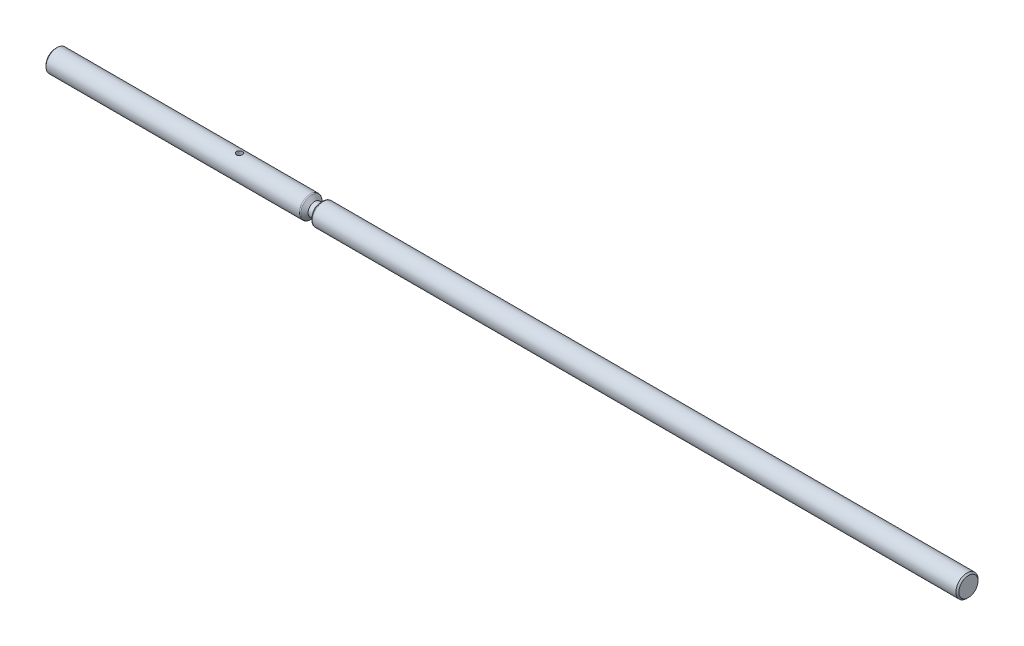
ISO-10303-21;
HEADER;
FILE_DESCRIPTION(('STEP AP214'),'2;1');
FILE_NAME('part.step','',(''),(''),'','','');
FILE_SCHEMA(('AUTOMOTIVE_DESIGN { 1 0 10303 214 1 1 1 1 }'));
ENDSEC;
DATA;
#1=APPLICATION_CONTEXT('core data for automotive mechanical design processes');
#2=APPLICATION_PROTOCOL_DEFINITION('international standard','automotive_design',2000,#1);
#3=PRODUCT_CONTEXT('',#1,'mechanical');
#4=PRODUCT('Part','Part','',(#3));
#5=PRODUCT_RELATED_PRODUCT_CATEGORY('part','',(#4));
#6=PRODUCT_DEFINITION_FORMATION('','',#4);
#7=PRODUCT_DEFINITION_CONTEXT('part definition',#1,'design');
#8=PRODUCT_DEFINITION('design','',#6,#7);
#9=PRODUCT_DEFINITION_SHAPE('','',#8);
#10=(LENGTH_UNIT() NAMED_UNIT(*) SI_UNIT(.MILLI.,.METRE.));
#11=(NAMED_UNIT(*) PLANE_ANGLE_UNIT() SI_UNIT($,.RADIAN.));
#12=(NAMED_UNIT(*) SI_UNIT($,.STERADIAN.) SOLID_ANGLE_UNIT());
#13=UNCERTAINTY_MEASURE_WITH_UNIT(LENGTH_MEASURE(1.E-05),#10,'distance_accuracy_value','');
#14=(GEOMETRIC_REPRESENTATION_CONTEXT(3) GLOBAL_UNCERTAINTY_ASSIGNED_CONTEXT((#13)) GLOBAL_UNIT_ASSIGNED_CONTEXT((#10,
#11,#12)) REPRESENTATION_CONTEXT('',''));
#15=CARTESIAN_POINT('',(0.,0.,0.));
#16=DIRECTION('',(0.,0.,1.));
#17=DIRECTION('',(1.,0.,0.));
#18=AXIS2_PLACEMENT_3D('',#15,#16,#17);
#19=CARTESIAN_POINT('',(0.,0.,0.));
#20=DIRECTION('',(1.,0.,0.));
#21=DIRECTION('',(0.,0.,-1.));
#22=AXIS2_PLACEMENT_3D('',#19,#20,#21);
#23=PLANE('',#22);
#24=CARTESIAN_POINT('',(0.,0.,0.));
#25=DIRECTION('',(-1.,0.,0.));
#26=DIRECTION('',(0.,0.,1.));
#27=AXIS2_PLACEMENT_3D('',#24,#25,#26);
#28=CIRCLE('',#27,6.49999999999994);
#29=CARTESIAN_POINT('',(0.,0.,6.49999999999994));
#30=VERTEX_POINT('',#29);
#31=EDGE_CURVE('E101',#30,#30,#28,.T.);
#32=ORIENTED_EDGE('',*,*,#31,.T.);
#33=EDGE_LOOP('',(#32));
#34=FACE_BOUND('',#33,.T.);
#35=ADVANCED_FACE('F25',(#34),#23,.F.);
#36=CARTESIAN_POINT('',(1.,0.,0.));
#37=DIRECTION('',(1.,0.,0.));
#38=DIRECTION('',(0.,0.,-1.));
#39=AXIS2_PLACEMENT_3D('',#36,#37,#38);
#40=CONICAL_SURFACE('',#39,7.49999999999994,0.785398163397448);
#41=ORIENTED_EDGE('',*,*,#31,.F.);
#42=EDGE_LOOP('',(#41));
#43=FACE_BOUND('',#42,.T.);
#44=CARTESIAN_POINT('',(1.,0.,0.));
#45=DIRECTION('',(-1.,0.,0.));
#46=DIRECTION('',(0.,0.,1.));
#47=AXIS2_PLACEMENT_3D('',#44,#45,#46);
#48=CIRCLE('',#47,7.49999999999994);
#49=CARTESIAN_POINT('',(1.,0.,7.49999999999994));
#50=VERTEX_POINT('',#49);
#51=EDGE_CURVE('E102',#50,#50,#48,.T.);
#52=ORIENTED_EDGE('',*,*,#51,.T.);
#53=EDGE_LOOP('',(#52));
#54=FACE_BOUND('',#53,.T.);
#55=ADVANCED_FACE('F91',(#43,#54),#40,.T.);
#56=CARTESIAN_POINT('',(0.,0.,0.));
#57=DIRECTION('',(-1.,0.,0.));
#58=DIRECTION('',(0.,0.,1.));
#59=AXIS2_PLACEMENT_3D('',#56,#57,#58);
#60=CYLINDRICAL_SURFACE('',#59,7.49999999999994);
#61=CARTESIAN_POINT('',(173.031625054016,0.,0.));
#62=DIRECTION('',(1.,0.,0.));
#63=DIRECTION('',(0.,0.,-1.));
#64=AXIS2_PLACEMENT_3D('',#61,#62,#63);
#65=CIRCLE('',#64,7.49999999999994);
#66=CARTESIAN_POINT('',(173.031625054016,0.,-7.49999999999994));
#67=VERTEX_POINT('',#66);
#68=EDGE_CURVE('E31',#67,#67,#65,.F.);
#69=ORIENTED_EDGE('',*,*,#68,.T.);
#70=EDGE_LOOP('',(#69));
#71=FACE_BOUND('',#70,.T.);
#72=CARTESIAN_POINT('',(123.,-7.49999999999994,0.));
#73=CARTESIAN_POINT('',(123.000002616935,-7.49999833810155,0.110254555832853));
#74=CARTESIAN_POINT('',(123.00914761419,-7.49754486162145,0.220537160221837));
#75=CARTESIAN_POINT('',(123.045421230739,-7.48799573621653,0.43792545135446));
#76=CARTESIAN_POINT('',(123.072558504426,-7.4808978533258,0.545029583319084));
#77=CARTESIAN_POINT('',(123.143871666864,-7.46284333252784,0.752891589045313));
#78=CARTESIAN_POINT('',(123.188025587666,-7.45189167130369,0.853657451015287));
#79=CARTESIAN_POINT('',(123.292037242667,-7.42728699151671,1.04635368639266));
#80=CARTESIAN_POINT('',(123.351896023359,-7.41363379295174,1.13828347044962));
#81=CARTESIAN_POINT('',(123.487083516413,-7.38474614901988,1.31282950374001));
#82=CARTESIAN_POINT('',(123.562708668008,-7.36948467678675,1.39521168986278));
#83=CARTESIAN_POINT('',(123.726648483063,-7.33927409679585,1.54628713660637));
#84=CARTESIAN_POINT('',(123.814964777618,-7.32432502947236,1.61497863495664));
#85=CARTESIAN_POINT('',(124.003648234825,-7.29615537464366,1.73786409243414));
#86=CARTESIAN_POINT('',(124.104196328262,-7.28296888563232,1.79178877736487));
#87=CARTESIAN_POINT('',(124.313340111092,-7.26021477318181,1.88187548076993));
#88=CARTESIAN_POINT('',(124.421934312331,-7.25064648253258,1.91804077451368));
#89=CARTESIAN_POINT('',(124.641495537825,-7.23649115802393,1.97076920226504));
#90=CARTESIAN_POINT('',(124.752353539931,-7.23179647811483,1.98775670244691));
#91=CARTESIAN_POINT('',(124.975437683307,-7.22759830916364,2.00297034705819));
#92=CARTESIAN_POINT('',(125.087663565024,-7.22809385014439,2.00119999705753));
#93=CARTESIAN_POINT('',(125.306985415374,-7.23412378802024,1.97928510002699));
#94=CARTESIAN_POINT('',(125.414137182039,-7.23951735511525,1.95965406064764));
#95=CARTESIAN_POINT('',(125.623568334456,-7.25451013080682,1.90339748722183));
#96=CARTESIAN_POINT('',(125.725847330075,-7.26410967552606,1.86677059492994));
#97=CARTESIAN_POINT('',(125.923968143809,-7.2865566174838,1.77714356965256));
#98=CARTESIAN_POINT('',(126.019724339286,-7.29943942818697,1.72396341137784));
#99=CARTESIAN_POINT('',(126.201134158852,-7.32698229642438,1.60286503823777));
#100=CARTESIAN_POINT('',(126.286785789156,-7.3416427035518,1.53494392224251));
#101=CARTESIAN_POINT('',(126.448488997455,-7.37167510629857,1.38366607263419));
#102=CARTESIAN_POINT('',(126.524136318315,-7.38705471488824,1.29987812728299));
#103=CARTESIAN_POINT('',(126.66038878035,-7.4163638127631,1.12061766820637));
#104=CARTESIAN_POINT('',(126.720993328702,-7.43029324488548,1.02514469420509));
#105=CARTESIAN_POINT('',(126.825617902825,-7.45521820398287,0.824598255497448));
#106=CARTESIAN_POINT('',(126.869564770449,-7.46620072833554,0.719484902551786));
#107=CARTESIAN_POINT('',(126.939047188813,-7.48390044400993,0.503002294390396));
#108=CARTESIAN_POINT('',(126.964586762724,-7.49061856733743,0.391634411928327));
#109=CARTESIAN_POINT('',(126.995894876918,-7.49889158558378,0.169254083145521));
#110=CARTESIAN_POINT('',(127.002213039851,-7.50058997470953,0.0583242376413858));
#111=CARTESIAN_POINT('',(126.996416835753,-7.49904471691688,-0.163010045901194));
#112=CARTESIAN_POINT('',(126.984304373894,-7.49580158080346,-0.27341453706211));
#113=CARTESIAN_POINT('',(126.94244155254,-7.48483035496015,-0.488602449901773));
#114=CARTESIAN_POINT('',(126.912997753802,-7.47718026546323,-0.593449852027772));
#115=CARTESIAN_POINT('',(126.837664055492,-7.45826294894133,-0.796706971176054));
#116=CARTESIAN_POINT('',(126.791772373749,-7.44699532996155,-0.895115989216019));
#117=CARTESIAN_POINT('',(126.683826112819,-7.42175660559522,-1.08483847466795));
#118=CARTESIAN_POINT('',(126.621472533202,-7.40773686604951,-1.17597518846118));
#119=CARTESIAN_POINT('',(126.482748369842,-7.37861452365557,-1.34668463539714));
#120=CARTESIAN_POINT('',(126.406375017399,-7.36351170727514,-1.42625507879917));
#121=CARTESIAN_POINT('',(126.239214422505,-7.33339745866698,-1.57388924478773));
#122=CARTESIAN_POINT('',(126.148081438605,-7.31840061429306,-1.64156519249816));
#123=CARTESIAN_POINT('',(125.9554353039,-7.29066447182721,-1.76067191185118));
#124=CARTESIAN_POINT('',(125.853922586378,-7.2779250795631,-1.8121033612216));
#125=CARTESIAN_POINT('',(125.643904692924,-7.25629268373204,-1.89687411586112));
#126=CARTESIAN_POINT('',(125.535444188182,-7.24737748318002,-1.93031812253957));
#127=CARTESIAN_POINT('',(125.314160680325,-7.23439825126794,-1.97841205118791));
#128=CARTESIAN_POINT('',(125.201338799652,-7.23033298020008,-1.99306677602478));
#129=CARTESIAN_POINT('',(124.978505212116,-7.22761744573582,-2.00288989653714));
#130=CARTESIAN_POINT('',(124.868522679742,-7.22879397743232,-1.99868155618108));
#131=CARTESIAN_POINT('',(124.65089648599,-7.23602396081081,-1.97234376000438));
#132=CARTESIAN_POINT('',(124.543252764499,-7.24207728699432,-1.95021476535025));
#133=CARTESIAN_POINT('',(124.33414424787,-7.25827571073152,-1.88902515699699));
#134=CARTESIAN_POINT('',(124.232638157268,-7.26838885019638,-1.8500966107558));
#135=CARTESIAN_POINT('',(124.037521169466,-7.29156818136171,-1.75651554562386));
#136=CARTESIAN_POINT('',(123.9439115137,-7.30463483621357,-1.70186056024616));
#137=CARTESIAN_POINT('',(123.764269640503,-7.33272921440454,-1.57648909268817));
#138=CARTESIAN_POINT('',(123.678541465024,-7.34780333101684,-1.5053472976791));
#139=CARTESIAN_POINT('',(123.520037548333,-7.37795503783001,-1.349830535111));
#140=CARTESIAN_POINT('',(123.447264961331,-7.39303262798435,-1.26545235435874));
#141=CARTESIAN_POINT('',(123.315207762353,-7.42187812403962,-1.08367998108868));
#142=CARTESIAN_POINT('',(123.256244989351,-7.43561111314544,-0.986045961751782));
#143=CARTESIAN_POINT('',(123.155662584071,-7.45983810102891,-0.781888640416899));
#144=CARTESIAN_POINT('',(123.114031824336,-7.47033417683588,-0.675371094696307));
#145=CARTESIAN_POINT('',(123.054724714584,-7.48554752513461,-0.474374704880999));
#146=CARTESIAN_POINT('',(123.034250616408,-7.49092770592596,-0.380762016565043));
#147=CARTESIAN_POINT('',(123.006887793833,-7.4981544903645,-0.19143979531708));
#148=CARTESIAN_POINT('',(122.9999977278,-7.50000144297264,-0.0957304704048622));
#149=CARTESIAN_POINT('',(123.,-7.49999999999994,0.));
#150=B_SPLINE_CURVE_WITH_KNOTS('',3,(#72,#73,#74,#75,#76,#77,#78,#79,#80,#81,#82,#83,#84,#85,
#86,#87,#88,#89,#90,#91,#92,#93,#94,#95,#96,#97,#98,#99,#100,#101,#102,#103,#104,#105,#106,#107,
#108,#109,#110,#111,#112,#113,#114,#115,#116,#117,#118,#119,#120,#121,#122,#123,#124,#125,#126,
#127,#128,#129,#130,#131,#132,#133,#134,#135,#136,#137,#138,#139,#140,#141,#142,#143,#144,#145,
#146,#147,#148,#149),.UNSPECIFIED.,.T.,.F.,(4,2,2,2,2,2,2,2,2,2,2,2,2,2,2,2,2,2,2,2,2,2,2,2,2,2,
2,2,2,2,2,2,2,2,2,2,2,2,4),(0.,0.330412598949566,0.660984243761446,0.991130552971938,
1.32129886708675,1.65834897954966,1.99544244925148,2.33832582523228,2.681145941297,
3.01622158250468,3.3512346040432,3.67691002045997,4.00261146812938,4.33198673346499,
4.66142688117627,5.00161259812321,5.34181171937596,5.6834880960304,6.02508977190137,
6.35682717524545,6.68853028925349,7.01453535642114,7.34057575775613,7.67300286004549,
8.00549568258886,8.34736496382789,8.68921998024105,9.02906297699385,9.36881908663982,
9.69743342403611,10.0260393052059,10.352107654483,10.67822717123,11.0139433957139,
11.3497412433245,11.6927225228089,12.0354832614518,12.3223981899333,12.6092847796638),.UNSPECIFIED.);
#151=CARTESIAN_POINT('',(123.,-7.49999999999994,0.));
#152=VERTEX_POINT('',#151);
#153=EDGE_CURVE('E44',#152,#152,#150,.T.);
#154=ORIENTED_EDGE('',*,*,#153,.T.);
#155=EDGE_LOOP('',(#154));
#156=FACE_BOUND('',#155,.T.);
#157=CARTESIAN_POINT('',(125.,7.22841614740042,2.));
#158=CARTESIAN_POINT('',(124.88982406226,7.22841805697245,1.99999734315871));
#159=CARTESIAN_POINT('',(124.779619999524,7.23096264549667,1.99086493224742));
#160=CARTESIAN_POINT('',(124.562394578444,7.2408356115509,1.95464583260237));
#161=CARTESIAN_POINT('',(124.455374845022,7.24816638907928,1.92755013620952));
#162=CARTESIAN_POINT('',(124.247691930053,7.26672375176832,1.85635845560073));
#163=CARTESIAN_POINT('',(124.147020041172,7.27794485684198,1.81228637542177));
#164=CARTESIAN_POINT('',(123.95448325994,7.30301154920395,1.70846784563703));
#165=CARTESIAN_POINT('',(123.862619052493,7.31685734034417,1.64872017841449));
#166=CARTESIAN_POINT('',(123.688007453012,7.3460013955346,1.51364847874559));
#167=CARTESIAN_POINT('',(123.605512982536,7.36132541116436,1.43800297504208));
#168=CARTESIAN_POINT('',(123.454218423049,7.39147701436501,1.2739742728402));
#169=CARTESIAN_POINT('',(123.385419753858,7.40630455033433,1.18558975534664));
#170=CARTESIAN_POINT('',(123.262415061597,7.43407988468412,0.996838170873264));
#171=CARTESIAN_POINT('',(123.208460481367,7.44699376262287,0.896301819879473));
#172=CARTESIAN_POINT('',(123.118315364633,7.46919126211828,0.687183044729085));
#173=CARTESIAN_POINT('',(123.082121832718,7.47847549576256,0.578601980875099));
#174=CARTESIAN_POINT('',(123.029344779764,7.49218553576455,0.359115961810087));
#175=CARTESIAN_POINT('',(123.012331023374,7.49671776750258,0.248321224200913));
#176=CARTESIAN_POINT('',(122.997042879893,7.50078524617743,0.0253635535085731));
#177=CARTESIAN_POINT('',(122.99876535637,7.50032132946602,-0.0867991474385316));
#178=CARTESIAN_POINT('',(123.020597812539,7.49452675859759,-0.306314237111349));
#179=CARTESIAN_POINT('',(123.040242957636,7.48931914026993,-0.413716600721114));
#180=CARTESIAN_POINT('',(123.096612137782,7.47476748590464,-0.623641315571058));
#181=CARTESIAN_POINT('',(123.133337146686,7.46542321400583,-0.726163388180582));
#182=CARTESIAN_POINT('',(123.223179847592,7.44346569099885,-0.924603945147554));
#183=CARTESIAN_POINT('',(123.276456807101,7.43082087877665,-1.02044668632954));
#184=CARTESIAN_POINT('',(123.397768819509,7.40362468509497,-1.20198999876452));
#185=CARTESIAN_POINT('',(123.465806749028,7.38907293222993,-1.28768858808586));
#186=CARTESIAN_POINT('',(123.617176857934,7.35911272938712,-1.44928536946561));
#187=CARTESIAN_POINT('',(123.700914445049,7.34369169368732,-1.52480192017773));
#188=CARTESIAN_POINT('',(123.880024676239,7.31413405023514,-1.66081332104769));
#189=CARTESIAN_POINT('',(123.9753980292,7.29999752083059,-1.72130725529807));
#190=CARTESIAN_POINT('',(124.175900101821,7.2745590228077,-1.82584679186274));
#191=CARTESIAN_POINT('',(124.281085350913,7.26327507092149,-1.86978866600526));
#192=CARTESIAN_POINT('',(124.497726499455,7.24504325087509,-1.93924001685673));
#193=CARTESIAN_POINT('',(124.60918083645,7.23809430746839,-1.96475406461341));
#194=CARTESIAN_POINT('',(124.831627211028,7.2295483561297,-1.99596757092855));
#195=CARTESIAN_POINT('',(124.942533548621,7.2277976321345,-2.00223632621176));
#196=CARTESIAN_POINT('',(125.163809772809,7.22942578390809,-1.9963498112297));
#197=CARTESIAN_POINT('',(125.27417971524,7.23280411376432,-1.98419650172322));
#198=CARTESIAN_POINT('',(125.489056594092,7.24416124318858,-1.9423127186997));
#199=CARTESIAN_POINT('',(125.593635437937,7.25205039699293,-1.91292447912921));
#200=CARTESIAN_POINT('',(125.79637963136,7.27145268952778,-1.83778986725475));
#201=CARTESIAN_POINT('',(125.894544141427,7.28296630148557,-1.79204135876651));
#202=CARTESIAN_POINT('',(126.084054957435,7.30863572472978,-1.68432905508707));
#203=CARTESIAN_POINT('',(126.17520397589,7.32284404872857,-1.62203095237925));
#204=CARTESIAN_POINT('',(126.345963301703,7.3521784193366,-1.48340227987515));
#205=CARTESIAN_POINT('',(126.425571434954,7.36730463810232,-1.40706907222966));
#206=CARTESIAN_POINT('',(126.57335247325,7.39729964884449,-1.23990378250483));
#207=CARTESIAN_POINT('',(126.641128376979,7.41214836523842,-1.14871641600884));
#208=CARTESIAN_POINT('',(126.760410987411,7.43946670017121,-0.955928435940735));
#209=CARTESIAN_POINT('',(126.811918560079,7.45193644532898,-0.854328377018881));
#210=CARTESIAN_POINT('',(126.896729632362,7.47301150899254,-0.644314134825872));
#211=CARTESIAN_POINT('',(126.930169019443,7.48164558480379,-0.535957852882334));
#212=CARTESIAN_POINT('',(126.978288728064,7.49420303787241,-0.314899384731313));
#213=CARTESIAN_POINT('',(126.992973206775,7.49812745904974,-0.202198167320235));
#214=CARTESIAN_POINT('',(127.002905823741,7.50077413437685,0.0206420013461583));
#215=CARTESIAN_POINT('',(126.998736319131,7.49965226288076,0.130753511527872));
#216=CARTESIAN_POINT('',(126.972431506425,7.49268490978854,0.348648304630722));
#217=CARTESIAN_POINT('',(126.950296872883,7.48683960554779,0.456431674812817));
#218=CARTESIAN_POINT('',(126.889019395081,7.47111310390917,0.665910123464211));
#219=CARTESIAN_POINT('',(126.849994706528,7.46125997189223,0.76764201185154));
#220=CARTESIAN_POINT('',(126.756150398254,7.43854816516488,0.963172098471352));
#221=CARTESIAN_POINT('',(126.701328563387,7.42568906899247,1.05696918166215));
#222=CARTESIAN_POINT('',(126.575741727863,7.39791331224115,1.23667826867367));
#223=CARTESIAN_POINT('',(126.504590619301,7.38295093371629,1.32231336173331));
#224=CARTESIAN_POINT('',(126.349097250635,7.3528400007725,1.48062537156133));
#225=CARTESIAN_POINT('',(126.264751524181,7.33769139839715,1.55329887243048));
#226=CARTESIAN_POINT('',(126.083031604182,7.30853959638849,1.68520700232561));
#227=CARTESIAN_POINT('',(125.985411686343,7.2945689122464,1.74411094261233));
#228=CARTESIAN_POINT('',(125.78129368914,7.26981393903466,1.84458689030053));
#229=CARTESIAN_POINT('',(125.674801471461,7.25902756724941,1.88617023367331));
#230=CARTESIAN_POINT('',(125.473918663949,7.24336000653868,1.9453812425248));
#231=CARTESIAN_POINT('',(125.380398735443,7.23780140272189,1.96581518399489));
#232=CARTESIAN_POINT('',(125.191259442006,7.23032885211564,1.99312494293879));
#233=CARTESIAN_POINT('',(125.095640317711,7.2284144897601,2.0000023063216));
#234=CARTESIAN_POINT('',(125.,7.22841614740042,2.));
#235=B_SPLINE_CURVE_WITH_KNOTS('',3,(#157,#158,#159,#160,#161,#162,#163,#164,#165,#166,#167,
#168,#169,#170,#171,#172,#173,#174,#175,#176,#177,#178,#179,#180,#181,#182,#183,#184,#185,#186,
#187,#188,#189,#190,#191,#192,#193,#194,#195,#196,#197,#198,#199,#200,#201,#202,#203,#204,#205,
#206,#207,#208,#209,#210,#211,#212,#213,#214,#215,#216,#217,#218,#219,#220,#221,#222,#223,#224,
#225,#226,#227,#228,#229,#230,#231,#232,#233,#234),.UNSPECIFIED.,.T.,.F.,(4,2,2,2,2,2,2,2,2,2,2,
2,2,2,2,2,2,2,2,2,2,2,2,2,2,2,2,2,2,2,2,2,2,2,2,2,2,2,4),(0.,0.33017612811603,0.660517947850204,
0.990396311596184,1.32030030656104,1.65765916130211,1.99505297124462,2.33785207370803,
2.68059334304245,3.0154830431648,3.35031668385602,3.67670570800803,4.00311334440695,
4.3327644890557,4.6624799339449,5.00231762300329,5.34217602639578,5.68413015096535,
6.02599942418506,6.35765334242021,6.68927196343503,7.01451850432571,7.3398075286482,
7.67224634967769,8.00474771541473,8.34685906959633,8.68895221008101,9.02843539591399,
9.36784331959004,9.69684054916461,10.0258254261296,10.3525451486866,10.6793107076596,
11.0147885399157,11.3503546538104,11.6933003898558,12.0360213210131,12.3226696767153,
12.6092853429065),.UNSPECIFIED.);
#236=CARTESIAN_POINT('',(125.,7.22841614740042,2.));
#237=VERTEX_POINT('',#236);
#238=EDGE_CURVE('E51',#237,#237,#235,.T.);
#239=ORIENTED_EDGE('',*,*,#238,.T.);
#240=EDGE_LOOP('',(#239));
#241=FACE_BOUND('',#240,.T.);
#242=ORIENTED_EDGE('',*,*,#51,.F.);
#243=EDGE_LOOP('',(#242));
#244=FACE_BOUND('',#243,.T.);
#245=ADVANCED_FACE('F55',(#71,#156,#241,#244),#60,.T.);
#246=CARTESIAN_POINT('',(176.,0.,0.));
#247=DIRECTION('',(-1.,0.,0.));
#248=DIRECTION('',(0.,0.,1.));
#249=AXIS2_PLACEMENT_3D('',#246,#247,#248);
#250=CONICAL_SURFACE('',#249,4.49999999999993,0.876058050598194);
#251=CARTESIAN_POINT('',(173.799846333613,0.,0.));
#252=DIRECTION('',(1.,0.,0.));
#253=DIRECTION('',(0.,0.,-1.));
#254=AXIS2_PLACEMENT_3D('',#251,#252,#253);
#255=CIRCLE('',#254,7.14018439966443);
#256=CARTESIAN_POINT('',(173.799846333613,0.,-7.14018439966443));
#257=VERTEX_POINT('',#256);
#258=EDGE_CURVE('E10',#257,#257,#255,.T.);
#259=ORIENTED_EDGE('',*,*,#258,.T.);
#260=EDGE_LOOP('',(#259));
#261=FACE_BOUND('',#260,.T.);
#262=CARTESIAN_POINT('',(176.,0.,0.));
#263=DIRECTION('',(-1.,0.,0.));
#264=DIRECTION('',(0.,0.,1.));
#265=AXIS2_PLACEMENT_3D('',#262,#263,#264);
#266=CIRCLE('',#265,4.49999999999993);
#267=CARTESIAN_POINT('',(176.,0.,4.49999999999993));
#268=VERTEX_POINT('',#267);
#269=EDGE_CURVE('E105',#268,#268,#266,.T.);
#270=ORIENTED_EDGE('',*,*,#269,.T.);
#271=EDGE_LOOP('',(#270));
#272=FACE_BOUND('',#271,.T.);
#273=ADVANCED_FACE('F85',(#261,#272),#250,.T.);
#274=CARTESIAN_POINT('',(0.,0.,0.));
#275=DIRECTION('',(-1.,0.,0.));
#276=DIRECTION('',(0.,0.,1.));
#277=AXIS2_PLACEMENT_3D('',#274,#275,#276);
#278=CYLINDRICAL_SURFACE('',#277,4.49999999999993);
#279=ORIENTED_EDGE('',*,*,#269,.F.);
#280=EDGE_LOOP('',(#279));
#281=FACE_BOUND('',#280,.T.);
#282=CARTESIAN_POINT('',(179.,0.,0.));
#283=DIRECTION('',(-1.,0.,0.));
#284=DIRECTION('',(0.,0.,1.));
#285=AXIS2_PLACEMENT_3D('',#282,#283,#284);
#286=CIRCLE('',#285,4.49999999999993);
#287=CARTESIAN_POINT('',(179.,0.,4.49999999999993));
#288=VERTEX_POINT('',#287);
#289=EDGE_CURVE('E110',#288,#288,#286,.T.);
#290=ORIENTED_EDGE('',*,*,#289,.T.);
#291=EDGE_LOOP('',(#290));
#292=FACE_BOUND('',#291,.T.);
#293=ADVANCED_FACE('F82',(#281,#292),#278,.T.);
#294=CARTESIAN_POINT('',(181.5,0.,0.));
#295=DIRECTION('',(1.,0.,0.));
#296=DIRECTION('',(0.,0.,-1.));
#297=AXIS2_PLACEMENT_3D('',#294,#295,#296);
#298=CONICAL_SURFACE('',#297,7.49999999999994,0.876058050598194);
#299=CARTESIAN_POINT('',(181.200153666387,0.,0.));
#300=DIRECTION('',(-1.,0.,0.));
#301=DIRECTION('',(0.,0.,1.));
#302=AXIS2_PLACEMENT_3D('',#299,#300,#301);
#303=CIRCLE('',#302,7.14018439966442);
#304=CARTESIAN_POINT('',(181.200153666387,0.,7.14018439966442));
#305=VERTEX_POINT('',#304);
#306=EDGE_CURVE('E39',#305,#305,#303,.T.);
#307=ORIENTED_EDGE('',*,*,#306,.T.);
#308=EDGE_LOOP('',(#307));
#309=FACE_BOUND('',#308,.T.);
#310=ORIENTED_EDGE('',*,*,#289,.F.);
#311=EDGE_LOOP('',(#310));
#312=FACE_BOUND('',#311,.T.);
#313=ADVANCED_FACE('F78',(#309,#312),#298,.T.);
#314=CARTESIAN_POINT('',(0.,0.,0.));
#315=DIRECTION('',(-1.,0.,0.));
#316=DIRECTION('',(0.,0.,1.));
#317=AXIS2_PLACEMENT_3D('',#314,#315,#316);
#318=CYLINDRICAL_SURFACE('',#317,7.49999999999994);
#319=CARTESIAN_POINT('',(181.968374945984,0.,0.));
#320=DIRECTION('',(1.,0.,0.));
#321=DIRECTION('',(0.,0.,-1.));
#322=AXIS2_PLACEMENT_3D('',#319,#320,#321);
#323=CIRCLE('',#322,7.49999999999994);
#324=CARTESIAN_POINT('',(181.968374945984,0.,-7.49999999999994));
#325=VERTEX_POINT('',#324);
#326=EDGE_CURVE('E35',#325,#325,#323,.T.);
#327=ORIENTED_EDGE('',*,*,#326,.T.);
#328=EDGE_LOOP('',(#327));
#329=FACE_BOUND('',#328,.T.);
#330=CARTESIAN_POINT('',(619.,0.,0.));
#331=DIRECTION('',(-1.,0.,0.));
#332=DIRECTION('',(0.,0.,1.));
#333=AXIS2_PLACEMENT_3D('',#330,#331,#332);
#334=CIRCLE('',#333,7.49999999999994);
#335=CARTESIAN_POINT('',(619.,0.,7.49999999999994));
#336=VERTEX_POINT('',#335);
#337=EDGE_CURVE('E113',#336,#336,#334,.T.);
#338=ORIENTED_EDGE('',*,*,#337,.T.);
#339=EDGE_LOOP('',(#338));
#340=FACE_BOUND('',#339,.T.);
#341=ADVANCED_FACE('F74',(#329,#340),#318,.T.);
#342=CARTESIAN_POINT('',(620.,0.,0.));
#343=DIRECTION('',(-1.,0.,0.));
#344=DIRECTION('',(0.,0.,1.));
#345=AXIS2_PLACEMENT_3D('',#342,#343,#344);
#346=CONICAL_SURFACE('',#345,6.49999999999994,0.785398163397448);
#347=ORIENTED_EDGE('',*,*,#337,.F.);
#348=EDGE_LOOP('',(#347));
#349=FACE_BOUND('',#348,.T.);
#350=CARTESIAN_POINT('',(620.,0.,0.));
#351=DIRECTION('',(-1.,0.,0.));
#352=DIRECTION('',(0.,0.,1.));
#353=AXIS2_PLACEMENT_3D('',#350,#351,#352);
#354=CIRCLE('',#353,6.49999999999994);
#355=CARTESIAN_POINT('',(620.,0.,6.49999999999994));
#356=VERTEX_POINT('',#355);
#357=EDGE_CURVE('E116',#356,#356,#354,.T.);
#358=ORIENTED_EDGE('',*,*,#357,.T.);
#359=EDGE_LOOP('',(#358));
#360=FACE_BOUND('',#359,.T.);
#361=ADVANCED_FACE('F70',(#349,#360),#346,.T.);
#362=CARTESIAN_POINT('',(620.,6.49999999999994,0.));
#363=DIRECTION('',(-1.,0.,0.));
#364=DIRECTION('',(0.,0.,1.));
#365=AXIS2_PLACEMENT_3D('',#362,#363,#364);
#366=PLANE('',#365);
#367=ORIENTED_EDGE('',*,*,#357,.F.);
#368=EDGE_LOOP('',(#367));
#369=FACE_BOUND('',#368,.T.);
#370=ADVANCED_FACE('F64',(#369),#366,.F.);
#371=CARTESIAN_POINT('',(125.,-7.49999999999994,0.));
#372=DIRECTION('',(0.,1.,0.));
#373=DIRECTION('',(0.,0.,1.));
#374=AXIS2_PLACEMENT_3D('',#371,#372,#373);
#375=CYLINDRICAL_SURFACE('',#374,2.);
#376=ORIENTED_EDGE('',*,*,#238,.F.);
#377=EDGE_LOOP('',(#376));
#378=FACE_BOUND('',#377,.T.);
#379=ORIENTED_EDGE('',*,*,#153,.F.);
#380=EDGE_LOOP('',(#379));
#381=FACE_BOUND('',#380,.T.);
#382=ADVANCED_FACE('F58',(#378,#381),#375,.F.);
#383=CARTESIAN_POINT('',(181.968374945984,0.,0.));
#384=DIRECTION('',(1.,0.,0.));
#385=DIRECTION('',(0.,0.,-1.));
#386=AXIS2_PLACEMENT_3D('',#383,#384,#385);
#387=TOROIDAL_SURFACE('',#386,6.49999999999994,1.);
#388=ORIENTED_EDGE('',*,*,#326,.F.);
#389=EDGE_LOOP('',(#388));
#390=FACE_BOUND('',#389,.T.);
#391=ORIENTED_EDGE('',*,*,#306,.F.);
#392=EDGE_LOOP('',(#391));
#393=FACE_BOUND('',#392,.T.);
#394=ADVANCED_FACE('F63',(#390,#393),#387,.T.);
#395=CARTESIAN_POINT('',(173.031625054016,0.,0.));
#396=DIRECTION('',(1.,0.,0.));
#397=DIRECTION('',(0.,0.,-1.));
#398=AXIS2_PLACEMENT_3D('',#395,#396,#397);
#399=TOROIDAL_SURFACE('',#398,6.49999999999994,1.);
#400=ORIENTED_EDGE('',*,*,#258,.F.);
#401=EDGE_LOOP('',(#400));
#402=FACE_BOUND('',#401,.T.);
#403=ORIENTED_EDGE('',*,*,#68,.F.);
#404=EDGE_LOOP('',(#403));
#405=FACE_BOUND('',#404,.T.);
#406=ADVANCED_FACE('F167',(#402,#405),#399,.T.);
#407=CLOSED_SHELL('',(#35,#55,#245,#273,#293,#313,#341,#361,#370,#382,#394,#406));
#408=MANIFOLD_SOLID_BREP('B2',#407);
#409=ADVANCED_BREP_SHAPE_REPRESENTATION('',(#18,#408),#14);
#410=SHAPE_DEFINITION_REPRESENTATION(#9,#409);
ENDSEC;
END-ISO-10303-21;
